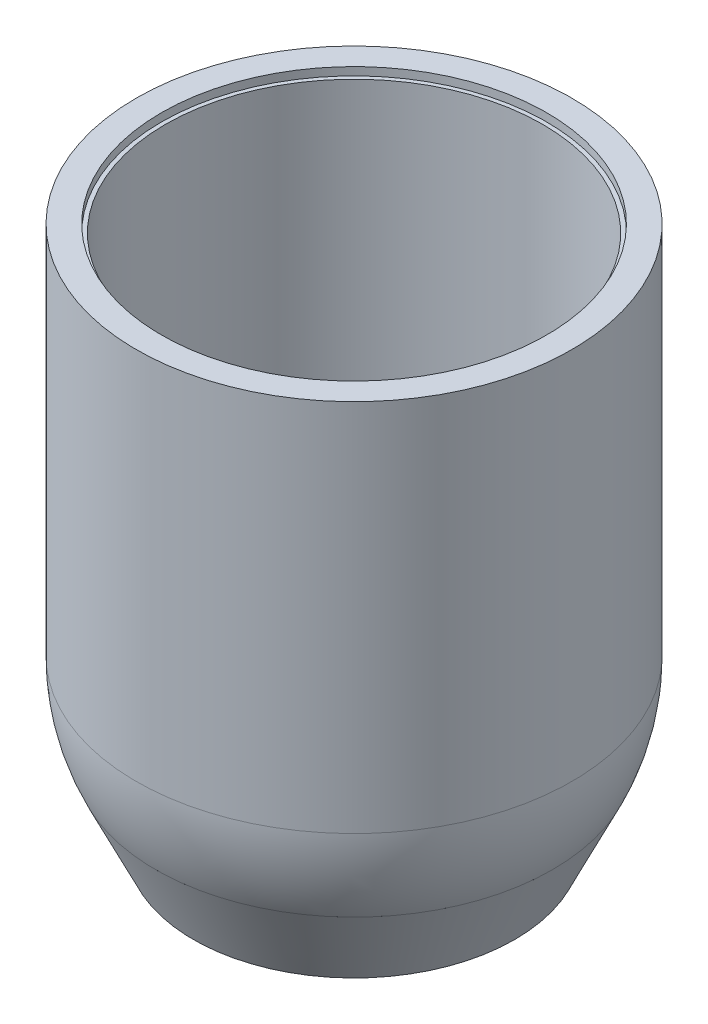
from build123d import *


with BuildPart() as part:
    # Esquisse1 → R_volution1 (revolve)
    with BuildSketch(Plane.XY):
        with BuildLine():
            Line((0, 0), (0, -185.45))
            ThreePointArc((0, -185.45), (2.436803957, -207.335748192), (9.627858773, -228.149510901))
            Line((9.627858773, -228.149510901), (9.626829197, -228.15))
            Line((9.626829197, -228.15), (28.32, -267.5))
            Line((28.32, -267.5), (33.287820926, -267.5))
            ThreePointArc((33.287820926, -267.5), (32.242482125, -266.438576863), (31.5562646, -265.116284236))
            Line((31.5562646, -265.116284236), (12.768443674, -210.116284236))
            ThreePointArc((12.768443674, -210.116284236), (12.567567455, -209.319212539), (12.5, -208.5))
            Line((12.5, -208.5), (12.5, -163.5))
            Line((12.5, -163.5), (14.5, -163.5))
            Line((14.5, -163.5), (14.5, -4))
            Line((14.5, -4), (12.5, -4))
            Line((12.5, -4), (12.5, 0))
            Line((12.5, 0), (0, 0))
        make_face()
    revolve(axis=Axis((108, 121.933306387, 0), (0, -1, 0)))


solid = part.part
